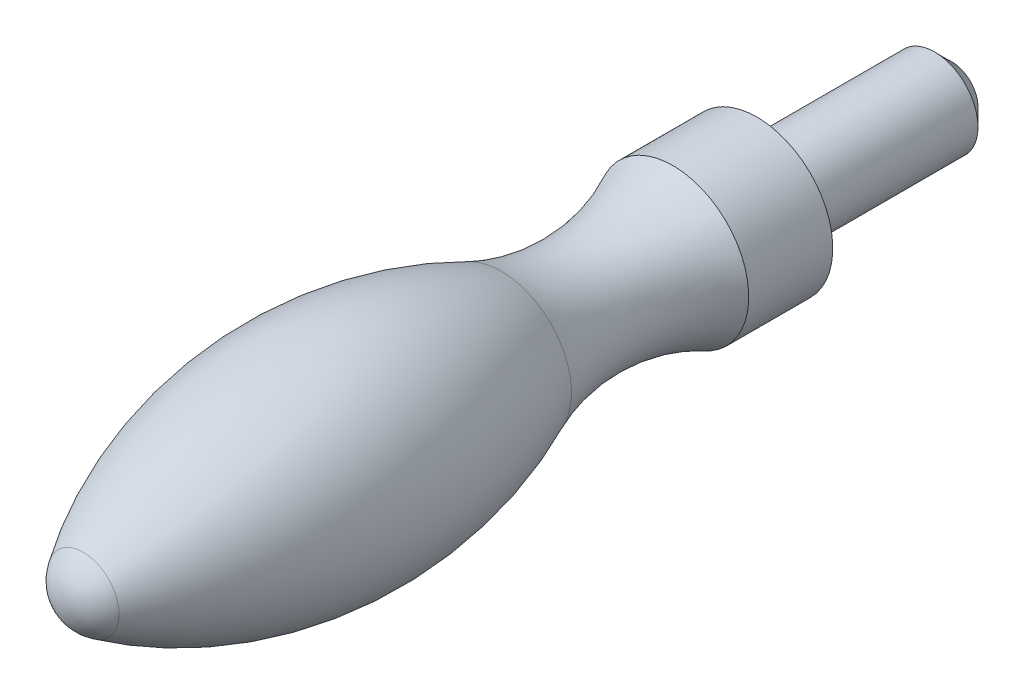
ISO-10303-21;
HEADER;
FILE_DESCRIPTION(('STEP AP214'),'2;1');
FILE_NAME('part.step','',(''),(''),'','','');
FILE_SCHEMA(('AUTOMOTIVE_DESIGN { 1 0 10303 214 1 1 1 1 }'));
ENDSEC;
DATA;
#1=APPLICATION_CONTEXT('core data for automotive mechanical design processes');
#2=APPLICATION_PROTOCOL_DEFINITION('international standard','automotive_design',2000,#1);
#3=PRODUCT_CONTEXT('',#1,'mechanical');
#4=PRODUCT('Part','Part','',(#3));
#5=PRODUCT_RELATED_PRODUCT_CATEGORY('part','',(#4));
#6=PRODUCT_DEFINITION_FORMATION('','',#4);
#7=PRODUCT_DEFINITION_CONTEXT('part definition',#1,'design');
#8=PRODUCT_DEFINITION('design','',#6,#7);
#9=PRODUCT_DEFINITION_SHAPE('','',#8);
#10=(LENGTH_UNIT() NAMED_UNIT(*) SI_UNIT(.MILLI.,.METRE.));
#11=(NAMED_UNIT(*) PLANE_ANGLE_UNIT() SI_UNIT($,.RADIAN.));
#12=(NAMED_UNIT(*) SI_UNIT($,.STERADIAN.) SOLID_ANGLE_UNIT());
#13=UNCERTAINTY_MEASURE_WITH_UNIT(LENGTH_MEASURE(1.E-05),#10,'distance_accuracy_value','');
#14=(GEOMETRIC_REPRESENTATION_CONTEXT(3) GLOBAL_UNCERTAINTY_ASSIGNED_CONTEXT((#13)) GLOBAL_UNIT_ASSIGNED_CONTEXT((#10,
#11,#12)) REPRESENTATION_CONTEXT('',''));
#15=CARTESIAN_POINT('',(0.,0.,0.));
#16=DIRECTION('',(0.,0.,1.));
#17=DIRECTION('',(1.,0.,0.));
#18=AXIS2_PLACEMENT_3D('',#15,#16,#17);
#19=CARTESIAN_POINT('',(0.,0.,-11.4999999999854));
#20=DIRECTION('',(0.,0.,-1.));
#21=DIRECTION('',(-1.,0.,0.));
#22=AXIS2_PLACEMENT_3D('',#19,#20,#21);
#23=CYLINDRICAL_SURFACE('',#22,2.);
#24=CARTESIAN_POINT('',(0.,0.,-8.19999999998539));
#25=DIRECTION('',(0.,0.,1.));
#26=DIRECTION('',(1.,0.,0.));
#27=AXIS2_PLACEMENT_3D('',#24,#25,#26);
#28=CIRCLE('',#27,2.);
#29=CARTESIAN_POINT('',(2.,0.,-8.19999999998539));
#30=VERTEX_POINT('',#29);
#31=EDGE_CURVE('E8',#30,#30,#28,.T.);
#32=ORIENTED_EDGE('',*,*,#31,.T.);
#33=EDGE_LOOP('',(#32));
#34=FACE_BOUND('',#33,.T.);
#35=CARTESIAN_POINT('',(0.,0.,0.));
#36=DIRECTION('',(0.,0.,-1.));
#37=DIRECTION('',(-1.,0.,0.));
#38=AXIS2_PLACEMENT_3D('',#35,#36,#37);
#39=CIRCLE('',#38,2.);
#40=CARTESIAN_POINT('',(-2.,0.,0.));
#41=VERTEX_POINT('',#40);
#42=EDGE_CURVE('E38',#41,#41,#39,.T.);
#43=ORIENTED_EDGE('',*,*,#42,.T.);
#44=EDGE_LOOP('',(#43));
#45=FACE_BOUND('',#44,.T.);
#46=ADVANCED_FACE('F12',(#34,#45),#23,.T.);
#47=CARTESIAN_POINT('',(0.,2.,-8.9999999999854));
#48=DIRECTION('',(0.,0.,1.));
#49=DIRECTION('',(1.,0.,0.));
#50=AXIS2_PLACEMENT_3D('',#47,#48,#49);
#51=PLANE('',#50);
#52=CARTESIAN_POINT('',(0.,0.,-8.9999999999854));
#53=DIRECTION('',(0.,0.,1.));
#54=DIRECTION('',(1.,0.,0.));
#55=AXIS2_PLACEMENT_3D('',#52,#53,#54);
#56=CIRCLE('',#55,1.2);
#57=CARTESIAN_POINT('',(1.2,0.,-8.9999999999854));
#58=VERTEX_POINT('',#57);
#59=EDGE_CURVE('E19',#58,#58,#56,.F.);
#60=ORIENTED_EDGE('',*,*,#59,.T.);
#61=EDGE_LOOP('',(#60));
#62=FACE_BOUND('',#61,.T.);
#63=ADVANCED_FACE('F69',(#62),#51,.F.);
#64=CARTESIAN_POINT('',(0.,0.,30.0600000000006));
#65=DIRECTION('',(-1.,0.,0.));
#66=DIRECTION('',(0.,0.,1.));
#67=AXIS2_PLACEMENT_3D('',#64,#65,#66);
#68=SPHERICAL_SURFACE('',#67,1.94);
#69=CARTESIAN_POINT('',(0.,0.,30.0600000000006));
#70=DIRECTION('',(0.,0.,-1.));
#71=DIRECTION('',(-1.,0.,0.));
#72=AXIS2_PLACEMENT_3D('',#69,#70,#71);
#73=SPHERICAL_SURFACE('',#72,1.94);
#74=CARTESIAN_POINT('',(0.,0.,31.0826143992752));
#75=DIRECTION('',(0.,0.,-1.));
#76=DIRECTION('',(-1.,0.,0.));
#77=AXIS2_PLACEMENT_3D('',#74,#75,#76);
#78=CIRCLE('',#77,1.64859327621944);
#79=CARTESIAN_POINT('',(-1.64859327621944,0.,31.0826143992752));
#80=VERTEX_POINT('',#79);
#81=EDGE_CURVE('E23',#80,#80,#78,.T.);
#82=ORIENTED_EDGE('',*,*,#81,.F.);
#83=EDGE_LOOP('',(#82));
#84=FACE_BOUND('',#83,.T.);
#85=ADVANCED_FACE('F65',(#84),#73,.T.);
#86=CARTESIAN_POINT('',(0.,0.,20.));
#87=DIRECTION('',(0.,0.,-1.));
#88=DIRECTION('',(-1.,0.,0.));
#89=AXIS2_PLACEMENT_3D('',#86,#87,#88);
#90=DEGENERATE_TOROIDAL_SURFACE('',#89,15.,20.,.F.);
#91=CARTESIAN_POINT('',(0.,0.,11.8000698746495));
#92=DIRECTION('',(0.,0.,-1.));
#93=DIRECTION('',(-1.,0.,0.));
#94=AXIS2_PLACEMENT_3D('',#91,#92,#93);
#95=CIRCLE('',#94,3.24174185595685);
#96=CARTESIAN_POINT('',(-3.24174185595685,0.,11.8000698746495));
#97=VERTEX_POINT('',#96);
#98=EDGE_CURVE('E27',#97,#97,#95,.T.);
#99=ORIENTED_EDGE('',*,*,#98,.F.);
#100=EDGE_LOOP('',(#99));
#101=FACE_BOUND('',#100,.T.);
#102=ORIENTED_EDGE('',*,*,#81,.T.);
#103=EDGE_LOOP('',(#102));
#104=FACE_BOUND('',#103,.T.);
#105=ADVANCED_FACE('F57',(#101,#104),#90,.F.);
#106=CARTESIAN_POINT('',(0.,0.,8.12000000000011));
#107=DIRECTION('',(0.,0.,-1.));
#108=DIRECTION('',(-1.,0.,0.));
#109=AXIS2_PLACEMENT_3D('',#106,#107,#108);
#110=TOROIDAL_SURFACE('',#109,12.,9.5);
#111=ORIENTED_EDGE('',*,*,#98,.T.);
#112=EDGE_LOOP('',(#111));
#113=FACE_BOUND('',#112,.T.);
#114=CARTESIAN_POINT('',(0.,0.,3.87735931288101));
#115=DIRECTION('',(0.,0.,-1.));
#116=DIRECTION('',(-1.,0.,0.));
#117=AXIS2_PLACEMENT_3D('',#114,#115,#116);
#118=CIRCLE('',#117,3.49999999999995);
#119=CARTESIAN_POINT('',(-3.49999999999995,0.,3.87735931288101));
#120=VERTEX_POINT('',#119);
#121=EDGE_CURVE('E32',#120,#120,#118,.T.);
#122=ORIENTED_EDGE('',*,*,#121,.F.);
#123=EDGE_LOOP('',(#122));
#124=FACE_BOUND('',#123,.T.);
#125=ADVANCED_FACE('F52',(#113,#124),#110,.F.);
#126=CARTESIAN_POINT('',(0.,0.,-11.4999999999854));
#127=DIRECTION('',(0.,0.,-1.));
#128=DIRECTION('',(-1.,0.,0.));
#129=AXIS2_PLACEMENT_3D('',#126,#127,#128);
#130=CYLINDRICAL_SURFACE('',#129,3.5);
#131=CARTESIAN_POINT('',(0.,0.,0.));
#132=DIRECTION('',(0.,0.,-1.));
#133=DIRECTION('',(-1.,0.,0.));
#134=AXIS2_PLACEMENT_3D('',#131,#132,#133);
#135=CIRCLE('',#134,3.5);
#136=CARTESIAN_POINT('',(-3.5,0.,0.));
#137=VERTEX_POINT('',#136);
#138=EDGE_CURVE('E35',#137,#137,#135,.T.);
#139=ORIENTED_EDGE('',*,*,#138,.F.);
#140=EDGE_LOOP('',(#139));
#141=FACE_BOUND('',#140,.T.);
#142=ORIENTED_EDGE('',*,*,#121,.T.);
#143=EDGE_LOOP('',(#142));
#144=FACE_BOUND('',#143,.T.);
#145=ADVANCED_FACE('F46',(#141,#144),#130,.T.);
#146=CARTESIAN_POINT('',(0.,3.5,0.));
#147=DIRECTION('',(0.,0.,1.));
#148=DIRECTION('',(1.,0.,0.));
#149=AXIS2_PLACEMENT_3D('',#146,#147,#148);
#150=PLANE('',#149);
#151=ORIENTED_EDGE('',*,*,#42,.F.);
#152=EDGE_LOOP('',(#151));
#153=FACE_BOUND('',#152,.T.);
#154=ORIENTED_EDGE('',*,*,#138,.T.);
#155=EDGE_LOOP('',(#154));
#156=FACE_BOUND('',#155,.T.);
#157=ADVANCED_FACE('F43',(#153,#156),#150,.F.);
#158=CARTESIAN_POINT('',(0.,0.,-8.9999999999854));
#159=DIRECTION('',(0.,0.,1.));
#160=DIRECTION('',(1.,0.,0.));
#161=AXIS2_PLACEMENT_3D('',#158,#159,#160);
#162=CONICAL_SURFACE('',#161,1.2,0.785398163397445);
#163=ORIENTED_EDGE('',*,*,#31,.F.);
#164=EDGE_LOOP('',(#163));
#165=FACE_BOUND('',#164,.T.);
#166=ORIENTED_EDGE('',*,*,#59,.F.);
#167=EDGE_LOOP('',(#166));
#168=FACE_BOUND('',#167,.T.);
#169=ADVANCED_FACE('F14',(#165,#168),#162,.T.);
#170=CLOSED_SHELL('',(#46,#63,#85,#105,#125,#145,#157,#169));
#171=MANIFOLD_SOLID_BREP('B1',#170);
#172=ADVANCED_BREP_SHAPE_REPRESENTATION('',(#18,#171),#14);
#173=SHAPE_DEFINITION_REPRESENTATION(#9,#172);
ENDSEC;
END-ISO-10303-21;
